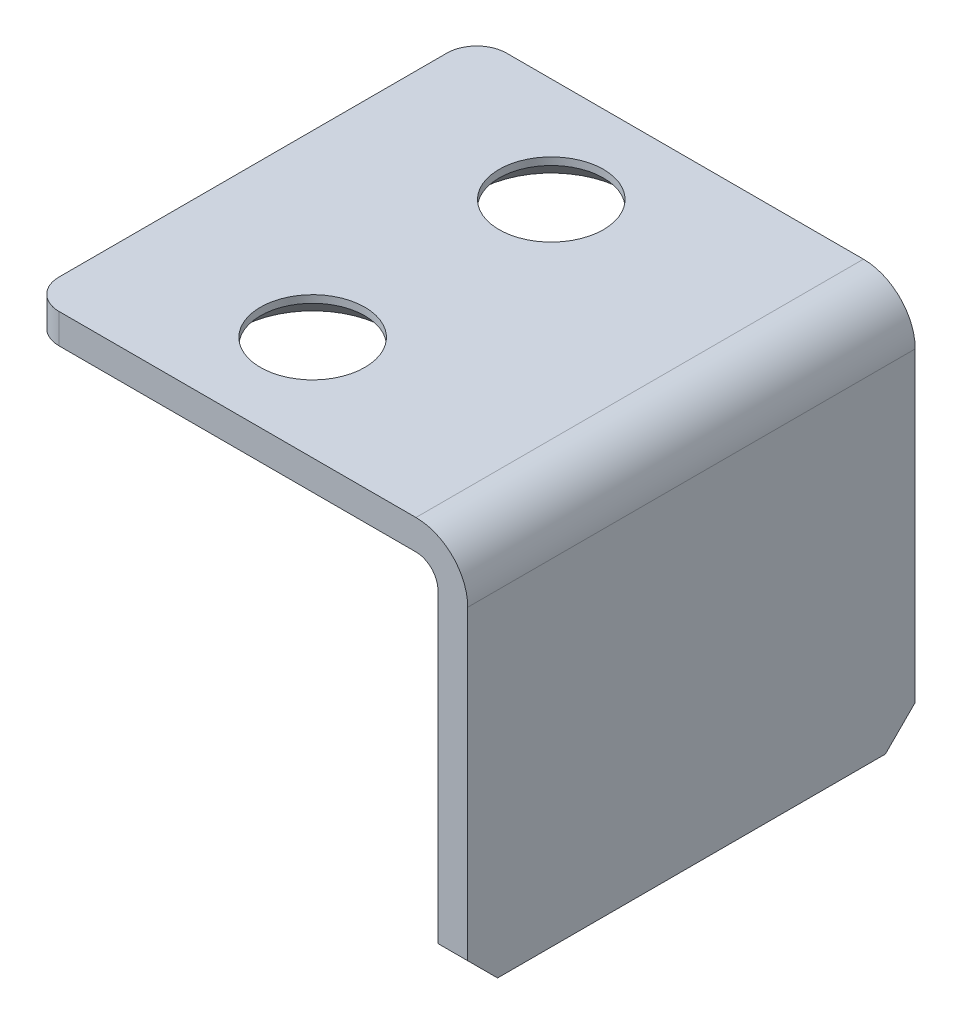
ISO-10303-21;
HEADER;
FILE_DESCRIPTION(('STEP AP214'),'2;1');
FILE_NAME('part.step','',(''),(''),'','','');
FILE_SCHEMA(('AUTOMOTIVE_DESIGN { 1 0 10303 214 1 1 1 1 }'));
ENDSEC;
DATA;
#1=APPLICATION_CONTEXT('core data for automotive mechanical design processes');
#2=APPLICATION_PROTOCOL_DEFINITION('international standard','automotive_design',2000,#1);
#3=PRODUCT_CONTEXT('',#1,'mechanical');
#4=PRODUCT('Part','Part','',(#3));
#5=PRODUCT_RELATED_PRODUCT_CATEGORY('part','',(#4));
#6=PRODUCT_DEFINITION_FORMATION('','',#4);
#7=PRODUCT_DEFINITION_CONTEXT('part definition',#1,'design');
#8=PRODUCT_DEFINITION('design','',#6,#7);
#9=PRODUCT_DEFINITION_SHAPE('','',#8);
#10=(LENGTH_UNIT() NAMED_UNIT(*) SI_UNIT(.MILLI.,.METRE.));
#11=(NAMED_UNIT(*) PLANE_ANGLE_UNIT() SI_UNIT($,.RADIAN.));
#12=(NAMED_UNIT(*) SI_UNIT($,.STERADIAN.) SOLID_ANGLE_UNIT());
#13=UNCERTAINTY_MEASURE_WITH_UNIT(LENGTH_MEASURE(1.E-05),#10,'distance_accuracy_value','');
#14=(GEOMETRIC_REPRESENTATION_CONTEXT(3) GLOBAL_UNCERTAINTY_ASSIGNED_CONTEXT((#13)) GLOBAL_UNIT_ASSIGNED_CONTEXT((#10,
#11,#12)) REPRESENTATION_CONTEXT('',''));
#15=CARTESIAN_POINT('',(0.,0.,0.));
#16=DIRECTION('',(0.,0.,1.));
#17=DIRECTION('',(1.,0.,0.));
#18=AXIS2_PLACEMENT_3D('',#15,#16,#17);
#19=CARTESIAN_POINT('',(50.0000000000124,-1.99999999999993,873.199999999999));
#20=DIRECTION('',(0.,-1.,0.));
#21=DIRECTION('',(0.,0.,-1.));
#22=AXIS2_PLACEMENT_3D('',#19,#20,#21);
#23=CONICAL_SURFACE('',#22,2.49999999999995,0.785398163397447);
#24=CARTESIAN_POINT('',(50.0000000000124,-1.99999999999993,873.199999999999));
#25=DIRECTION('',(0.,-1.,0.));
#26=DIRECTION('',(0.,0.,-1.));
#27=AXIS2_PLACEMENT_3D('',#24,#25,#26);
#28=CIRCLE('',#27,2.49999999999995);
#29=CARTESIAN_POINT('',(50.0000000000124,-1.99999999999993,870.699999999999));
#30=VERTEX_POINT('',#29);
#31=EDGE_CURVE('E11',#30,#30,#28,.T.);
#32=ORIENTED_EDGE('',*,*,#31,.T.);
#33=EDGE_LOOP('',(#32));
#34=FACE_BOUND('',#33,.T.);
#35=CARTESIAN_POINT('',(50.0000000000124,-1.24999999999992,873.199999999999));
#36=DIRECTION('',(0.,-1.,0.));
#37=DIRECTION('',(0.,0.,-1.));
#38=AXIS2_PLACEMENT_3D('',#35,#36,#37);
#39=CIRCLE('',#38,1.75000000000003);
#40=CARTESIAN_POINT('',(50.0000000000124,-1.24999999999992,871.449999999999));
#41=VERTEX_POINT('',#40);
#42=EDGE_CURVE('E252',#41,#41,#39,.T.);
#43=ORIENTED_EDGE('',*,*,#42,.F.);
#44=EDGE_LOOP('',(#43));
#45=FACE_BOUND('',#44,.T.);
#46=ADVANCED_FACE('F16',(#34,#45),#23,.F.);
#47=CARTESIAN_POINT('',(50.0000000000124,-1.99999999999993,873.199999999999));
#48=DIRECTION('',(0.,-1.,0.));
#49=DIRECTION('',(0.,0.,-1.));
#50=AXIS2_PLACEMENT_3D('',#47,#48,#49);
#51=CYLINDRICAL_SURFACE('',#50,1.75000000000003);
#52=ORIENTED_EDGE('',*,*,#42,.T.);
#53=EDGE_LOOP('',(#52));
#54=FACE_BOUND('',#53,.T.);
#55=CARTESIAN_POINT('',(50.0000000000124,-0.99999999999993,873.199999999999));
#56=DIRECTION('',(0.,1.,0.));
#57=DIRECTION('',(1.,0.,0.));
#58=AXIS2_PLACEMENT_3D('',#55,#56,#57);
#59=CIRCLE('',#58,1.74999999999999);
#60=CARTESIAN_POINT('',(51.7500000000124,-0.999999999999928,873.199999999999));
#61=VERTEX_POINT('',#60);
#62=EDGE_CURVE('E27',#61,#61,#59,.T.);
#63=ORIENTED_EDGE('',*,*,#62,.T.);
#64=EDGE_LOOP('',(#63));
#65=FACE_BOUND('',#64,.T.);
#66=ADVANCED_FACE('F263',(#54,#65),#51,.F.);
#67=CARTESIAN_POINT('',(50.0000000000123,-1.99999999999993,865.199999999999));
#68=DIRECTION('',(0.,-1.,0.));
#69=DIRECTION('',(0.,0.,-1.));
#70=AXIS2_PLACEMENT_3D('',#67,#68,#69);
#71=CONICAL_SURFACE('',#70,2.49999999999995,0.785398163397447);
#72=CARTESIAN_POINT('',(50.0000000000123,-1.99999999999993,865.199999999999));
#73=DIRECTION('',(0.,-1.,0.));
#74=DIRECTION('',(0.,0.,-1.));
#75=AXIS2_PLACEMENT_3D('',#72,#73,#74);
#76=CIRCLE('',#75,2.49999999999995);
#77=CARTESIAN_POINT('',(50.0000000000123,-1.99999999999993,862.699999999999));
#78=VERTEX_POINT('',#77);
#79=EDGE_CURVE('E248',#78,#78,#76,.T.);
#80=ORIENTED_EDGE('',*,*,#79,.T.);
#81=EDGE_LOOP('',(#80));
#82=FACE_BOUND('',#81,.T.);
#83=CARTESIAN_POINT('',(50.0000000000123,-1.24999999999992,865.199999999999));
#84=DIRECTION('',(0.,-1.,0.));
#85=DIRECTION('',(0.,0.,-1.));
#86=AXIS2_PLACEMENT_3D('',#83,#84,#85);
#87=CIRCLE('',#86,1.75000000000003);
#88=CARTESIAN_POINT('',(50.0000000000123,-1.24999999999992,863.449999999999));
#89=VERTEX_POINT('',#88);
#90=EDGE_CURVE('E241',#89,#89,#87,.T.);
#91=ORIENTED_EDGE('',*,*,#90,.F.);
#92=EDGE_LOOP('',(#91));
#93=FACE_BOUND('',#92,.T.);
#94=ADVANCED_FACE('F272',(#82,#93),#71,.F.);
#95=CARTESIAN_POINT('',(50.0000000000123,-1.99999999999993,865.199999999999));
#96=DIRECTION('',(0.,-1.,0.));
#97=DIRECTION('',(0.,0.,-1.));
#98=AXIS2_PLACEMENT_3D('',#95,#96,#97);
#99=CYLINDRICAL_SURFACE('',#98,1.75000000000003);
#100=ORIENTED_EDGE('',*,*,#90,.T.);
#101=EDGE_LOOP('',(#100));
#102=FACE_BOUND('',#101,.T.);
#103=CARTESIAN_POINT('',(50.0000000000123,-0.99999999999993,865.199999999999));
#104=DIRECTION('',(0.,1.,0.));
#105=DIRECTION('',(1.,0.,0.));
#106=AXIS2_PLACEMENT_3D('',#103,#104,#105);
#107=CIRCLE('',#106,1.74999999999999);
#108=CARTESIAN_POINT('',(51.7500000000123,-0.999999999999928,865.199999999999));
#109=VERTEX_POINT('',#108);
#110=EDGE_CURVE('E244',#109,#109,#107,.T.);
#111=ORIENTED_EDGE('',*,*,#110,.T.);
#112=EDGE_LOOP('',(#111));
#113=FACE_BOUND('',#112,.T.);
#114=ADVANCED_FACE('F277',(#102,#113),#99,.F.);
#115=CARTESIAN_POINT('',(56.9634000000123,-0.999999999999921,861.699999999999));
#116=DIRECTION('',(0.,0.,-1.));
#117=DIRECTION('',(0.,1.,0.));
#118=AXIS2_PLACEMENT_3D('',#115,#116,#117);
#119=PLANE('',#118);
#120=CARTESIAN_POINT('',(56.9634000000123,-2.73659999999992,861.699999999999));
#121=DIRECTION('',(0.,0.,1.));
#122=DIRECTION('',(0.,1.,0.));
#123=AXIS2_PLACEMENT_3D('',#120,#121,#122);
#124=CIRCLE('',#123,0.7366);
#125=CARTESIAN_POINT('',(57.7000000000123,-2.73659999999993,861.699999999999));
#126=VERTEX_POINT('',#125);
#127=CARTESIAN_POINT('',(56.9634000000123,-1.99999999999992,861.699999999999));
#128=VERTEX_POINT('',#127);
#129=EDGE_CURVE('E238',#126,#128,#124,.T.);
#130=ORIENTED_EDGE('',*,*,#129,.T.);
#131=DIRECTION('',(-1.,0.,0.));
#132=VECTOR('',#131,1.);
#133=CARTESIAN_POINT('',(58.7000000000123,-1.99999999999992,861.699999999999));
#134=LINE('',#133,#132);
#135=CARTESIAN_POINT('',(45.0000000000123,-1.99999999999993,861.699999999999));
#136=VERTEX_POINT('',#135);
#137=EDGE_CURVE('E234',#128,#136,#134,.T.);
#138=ORIENTED_EDGE('',*,*,#137,.T.);
#139=DIRECTION('',(0.,1.,0.));
#140=VECTOR('',#139,1.);
#141=CARTESIAN_POINT('',(45.0000000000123,-2.73659999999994,861.699999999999));
#142=LINE('',#141,#140);
#143=CARTESIAN_POINT('',(45.0000000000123,-0.999999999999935,861.699999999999));
#144=VERTEX_POINT('',#143);
#145=EDGE_CURVE('E228',#136,#144,#142,.T.);
#146=ORIENTED_EDGE('',*,*,#145,.T.);
#147=DIRECTION('',(-1.,0.,0.));
#148=VECTOR('',#147,1.);
#149=CARTESIAN_POINT('',(58.7000000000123,-0.999999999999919,861.699999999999));
#150=LINE('',#149,#148);
#151=CARTESIAN_POINT('',(56.9634000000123,-0.999999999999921,861.699999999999));
#152=VERTEX_POINT('',#151);
#153=EDGE_CURVE('E183',#152,#144,#150,.T.);
#154=ORIENTED_EDGE('',*,*,#153,.F.);
#155=CARTESIAN_POINT('',(56.9634000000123,-2.73659999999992,861.699999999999));
#156=DIRECTION('',(0.,0.,1.));
#157=DIRECTION('',(0.,1.,0.));
#158=AXIS2_PLACEMENT_3D('',#155,#156,#157);
#159=CIRCLE('',#158,1.7366);
#160=CARTESIAN_POINT('',(58.7000000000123,-2.73659999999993,861.699999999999));
#161=VERTEX_POINT('',#160);
#162=EDGE_CURVE('E36',#161,#152,#159,.T.);
#163=ORIENTED_EDGE('',*,*,#162,.F.);
#164=DIRECTION('',(0.,1.,0.));
#165=VECTOR('',#164,1.);
#166=CARTESIAN_POINT('',(58.7000000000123,-13.9999999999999,861.699999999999));
#167=LINE('',#166,#165);
#168=CARTESIAN_POINT('',(58.7000000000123,-12.9999999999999,861.699999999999));
#169=VERTEX_POINT('',#168);
#170=EDGE_CURVE('E135',#169,#161,#167,.T.);
#171=ORIENTED_EDGE('',*,*,#170,.F.);
#172=DIRECTION('',(-1.,0.,0.));
#173=VECTOR('',#172,1.);
#174=CARTESIAN_POINT('',(56.9634000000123,-12.9999999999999,861.699999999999));
#175=LINE('',#174,#173);
#176=CARTESIAN_POINT('',(57.7000000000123,-12.9999999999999,861.699999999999));
#177=VERTEX_POINT('',#176);
#178=EDGE_CURVE('E120',#169,#177,#175,.T.);
#179=ORIENTED_EDGE('',*,*,#178,.T.);
#180=DIRECTION('',(0.,1.,0.));
#181=VECTOR('',#180,1.);
#182=CARTESIAN_POINT('',(57.7000000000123,-13.9999999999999,861.699999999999));
#183=LINE('',#182,#181);
#184=EDGE_CURVE('E108',#177,#126,#183,.T.);
#185=ORIENTED_EDGE('',*,*,#184,.T.);
#186=EDGE_LOOP('',(#130,#138,#146,#154,#163,#171,#179,#185));
#187=FACE_BOUND('',#186,.T.);
#188=ADVANCED_FACE('F133',(#187),#119,.T.);
#189=CARTESIAN_POINT('',(58.7000000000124,-2.73659999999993,876.699999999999));
#190=DIRECTION('',(0.,0.,1.));
#191=DIRECTION('',(0.,-1.,0.));
#192=AXIS2_PLACEMENT_3D('',#189,#190,#191);
#193=PLANE('',#192);
#194=CARTESIAN_POINT('',(56.9634000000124,-2.73659999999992,876.699999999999));
#195=DIRECTION('',(0.,0.,1.));
#196=DIRECTION('',(0.,1.,0.));
#197=AXIS2_PLACEMENT_3D('',#194,#195,#196);
#198=CIRCLE('',#197,0.7366);
#199=CARTESIAN_POINT('',(57.7000000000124,-2.73659999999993,876.699999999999));
#200=VERTEX_POINT('',#199);
#201=CARTESIAN_POINT('',(56.9634000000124,-1.99999999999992,876.699999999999));
#202=VERTEX_POINT('',#201);
#203=EDGE_CURVE('E142',#200,#202,#198,.T.);
#204=ORIENTED_EDGE('',*,*,#203,.F.);
#205=DIRECTION('',(0.,1.,0.));
#206=VECTOR('',#205,1.);
#207=CARTESIAN_POINT('',(57.7000000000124,-13.9999999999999,876.699999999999));
#208=LINE('',#207,#206);
#209=CARTESIAN_POINT('',(57.7000000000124,-12.9999999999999,876.699999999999));
#210=VERTEX_POINT('',#209);
#211=EDGE_CURVE('E147',#210,#200,#208,.T.);
#212=ORIENTED_EDGE('',*,*,#211,.F.);
#213=DIRECTION('',(1.,0.,0.));
#214=VECTOR('',#213,1.);
#215=CARTESIAN_POINT('',(56.9634000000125,-12.9999999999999,876.699999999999));
#216=LINE('',#215,#214);
#217=CARTESIAN_POINT('',(58.7000000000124,-12.9999999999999,876.699999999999));
#218=VERTEX_POINT('',#217);
#219=EDGE_CURVE('E216',#210,#218,#216,.T.);
#220=ORIENTED_EDGE('',*,*,#219,.T.);
#221=DIRECTION('',(0.,1.,0.));
#222=VECTOR('',#221,1.);
#223=CARTESIAN_POINT('',(58.7000000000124,-13.9999999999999,876.699999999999));
#224=LINE('',#223,#222);
#225=CARTESIAN_POINT('',(58.7000000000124,-2.73659999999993,876.699999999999));
#226=VERTEX_POINT('',#225);
#227=EDGE_CURVE('E211',#218,#226,#224,.T.);
#228=ORIENTED_EDGE('',*,*,#227,.T.);
#229=CARTESIAN_POINT('',(56.9634000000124,-2.73659999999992,876.699999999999));
#230=DIRECTION('',(0.,0.,1.));
#231=DIRECTION('',(0.,1.,0.));
#232=AXIS2_PLACEMENT_3D('',#229,#230,#231);
#233=CIRCLE('',#232,1.7366);
#234=CARTESIAN_POINT('',(56.9634000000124,-0.999999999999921,876.699999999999));
#235=VERTEX_POINT('',#234);
#236=EDGE_CURVE('E220',#226,#235,#233,.T.);
#237=ORIENTED_EDGE('',*,*,#236,.T.);
#238=DIRECTION('',(-1.,0.,0.));
#239=VECTOR('',#238,1.);
#240=CARTESIAN_POINT('',(58.7000000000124,-0.999999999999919,876.699999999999));
#241=LINE('',#240,#239);
#242=CARTESIAN_POINT('',(45.0000000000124,-0.999999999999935,876.699999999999));
#243=VERTEX_POINT('',#242);
#244=EDGE_CURVE('E121',#235,#243,#241,.T.);
#245=ORIENTED_EDGE('',*,*,#244,.T.);
#246=DIRECTION('',(0.,-1.,0.));
#247=VECTOR('',#246,1.);
#248=CARTESIAN_POINT('',(45.0000000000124,-1.99999999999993,876.699999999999));
#249=LINE('',#248,#247);
#250=CARTESIAN_POINT('',(45.0000000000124,-1.99999999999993,876.699999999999));
#251=VERTEX_POINT('',#250);
#252=EDGE_CURVE('E20',#243,#251,#249,.T.);
#253=ORIENTED_EDGE('',*,*,#252,.T.);
#254=DIRECTION('',(-1.,0.,0.));
#255=VECTOR('',#254,1.);
#256=CARTESIAN_POINT('',(58.7000000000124,-1.99999999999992,876.699999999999));
#257=LINE('',#256,#255);
#258=EDGE_CURVE('E199',#202,#251,#257,.T.);
#259=ORIENTED_EDGE('',*,*,#258,.F.);
#260=EDGE_LOOP('',(#204,#212,#220,#228,#237,#245,#253,#259));
#261=FACE_BOUND('',#260,.T.);
#262=ADVANCED_FACE('F284',(#261),#193,.T.);
#263=CARTESIAN_POINT('',(58.7000000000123,-1.99999999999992,861.699999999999));
#264=DIRECTION('',(0.,1.,0.));
#265=DIRECTION('',(1.,0.,0.));
#266=AXIS2_PLACEMENT_3D('',#263,#264,#265);
#267=PLANE('',#266);
#268=ORIENTED_EDGE('',*,*,#31,.F.);
#269=EDGE_LOOP('',(#268));
#270=FACE_BOUND('',#269,.T.);
#271=ORIENTED_EDGE('',*,*,#79,.F.);
#272=EDGE_LOOP('',(#271));
#273=FACE_BOUND('',#272,.T.);
#274=DIRECTION('',(0.,0.,1.));
#275=VECTOR('',#274,1.);
#276=CARTESIAN_POINT('',(44.0000000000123,-1.99999999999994,861.699999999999));
#277=LINE('',#276,#275);
#278=CARTESIAN_POINT('',(44.0000000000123,-1.99999999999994,862.699999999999));
#279=VERTEX_POINT('',#278);
#280=CARTESIAN_POINT('',(44.0000000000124,-1.99999999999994,875.699999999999));
#281=VERTEX_POINT('',#280);
#282=EDGE_CURVE('E188',#279,#281,#277,.T.);
#283=ORIENTED_EDGE('',*,*,#282,.F.);
#284=CARTESIAN_POINT('',(45.0000000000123,-1.99999999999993,862.699999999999));
#285=DIRECTION('',(0.,-1.,0.));
#286=DIRECTION('',(1.,0.,0.));
#287=AXIS2_PLACEMENT_3D('',#284,#285,#286);
#288=CIRCLE('',#287,1.);
#289=EDGE_CURVE('E207',#279,#136,#288,.T.);
#290=ORIENTED_EDGE('',*,*,#289,.T.);
#291=ORIENTED_EDGE('',*,*,#137,.F.);
#292=DIRECTION('',(0.,0.,1.));
#293=VECTOR('',#292,1.);
#294=CARTESIAN_POINT('',(56.9634000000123,-1.99999999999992,861.699999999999));
#295=LINE('',#294,#293);
#296=EDGE_CURVE('E203',#128,#202,#295,.T.);
#297=ORIENTED_EDGE('',*,*,#296,.T.);
#298=ORIENTED_EDGE('',*,*,#258,.T.);
#299=CARTESIAN_POINT('',(45.0000000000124,-1.99999999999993,875.699999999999));
#300=DIRECTION('',(0.,-1.,0.));
#301=DIRECTION('',(1.,0.,0.));
#302=AXIS2_PLACEMENT_3D('',#299,#300,#301);
#303=CIRCLE('',#302,1.);
#304=EDGE_CURVE('E193',#251,#281,#303,.T.);
#305=ORIENTED_EDGE('',*,*,#304,.T.);
#306=EDGE_LOOP('',(#283,#290,#291,#297,#298,#305));
#307=FACE_BOUND('',#306,.T.);
#308=ADVANCED_FACE('F287',(#270,#273,#307),#267,.F.);
#309=CARTESIAN_POINT('',(44.0000000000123,-0.999999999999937,861.699999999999));
#310=DIRECTION('',(-1.,0.,0.));
#311=DIRECTION('',(0.,0.,1.));
#312=AXIS2_PLACEMENT_3D('',#309,#310,#311);
#313=PLANE('',#312);
#314=DIRECTION('',(0.,0.,1.));
#315=VECTOR('',#314,1.);
#316=CARTESIAN_POINT('',(44.0000000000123,-0.999999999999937,861.699999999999));
#317=LINE('',#316,#315);
#318=CARTESIAN_POINT('',(44.0000000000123,-0.999999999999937,862.699999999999));
#319=VERTEX_POINT('',#318);
#320=CARTESIAN_POINT('',(44.0000000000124,-0.999999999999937,875.699999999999));
#321=VERTEX_POINT('',#320);
#322=EDGE_CURVE('E178',#319,#321,#317,.T.);
#323=ORIENTED_EDGE('',*,*,#322,.F.);
#324=DIRECTION('',(0.,-1.,0.));
#325=VECTOR('',#324,1.);
#326=CARTESIAN_POINT('',(44.0000000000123,-0.999999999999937,862.699999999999));
#327=LINE('',#326,#325);
#328=EDGE_CURVE('E189',#319,#279,#327,.T.);
#329=ORIENTED_EDGE('',*,*,#328,.T.);
#330=ORIENTED_EDGE('',*,*,#282,.T.);
#331=DIRECTION('',(0.,1.,0.));
#332=VECTOR('',#331,1.);
#333=CARTESIAN_POINT('',(44.0000000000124,-0.999999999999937,875.699999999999));
#334=LINE('',#333,#332);
#335=EDGE_CURVE('E184',#281,#321,#334,.T.);
#336=ORIENTED_EDGE('',*,*,#335,.T.);
#337=EDGE_LOOP('',(#323,#329,#330,#336));
#338=FACE_BOUND('',#337,.T.);
#339=ADVANCED_FACE('F291',(#338),#313,.T.);
#340=CARTESIAN_POINT('',(58.7000000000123,-0.999999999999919,861.699999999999));
#341=DIRECTION('',(0.,1.,0.));
#342=DIRECTION('',(1.,0.,0.));
#343=AXIS2_PLACEMENT_3D('',#340,#341,#342);
#344=PLANE('',#343);
#345=ORIENTED_EDGE('',*,*,#62,.F.);
#346=EDGE_LOOP('',(#345));
#347=FACE_BOUND('',#346,.T.);
#348=ORIENTED_EDGE('',*,*,#110,.F.);
#349=EDGE_LOOP('',(#348));
#350=FACE_BOUND('',#349,.T.);
#351=ORIENTED_EDGE('',*,*,#153,.T.);
#352=CARTESIAN_POINT('',(45.0000000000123,-0.999999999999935,862.699999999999));
#353=DIRECTION('',(0.,1.,0.));
#354=DIRECTION('',(1.,0.,0.));
#355=AXIS2_PLACEMENT_3D('',#352,#353,#354);
#356=CIRCLE('',#355,1.);
#357=EDGE_CURVE('E179',#144,#319,#356,.T.);
#358=ORIENTED_EDGE('',*,*,#357,.T.);
#359=ORIENTED_EDGE('',*,*,#322,.T.);
#360=CARTESIAN_POINT('',(45.0000000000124,-0.999999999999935,875.699999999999));
#361=DIRECTION('',(0.,1.,0.));
#362=DIRECTION('',(1.,0.,0.));
#363=AXIS2_PLACEMENT_3D('',#360,#361,#362);
#364=CIRCLE('',#363,1.);
#365=EDGE_CURVE('E174',#321,#243,#364,.T.);
#366=ORIENTED_EDGE('',*,*,#365,.T.);
#367=ORIENTED_EDGE('',*,*,#244,.F.);
#368=DIRECTION('',(0.,0.,1.));
#369=VECTOR('',#368,1.);
#370=CARTESIAN_POINT('',(56.9634000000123,-0.999999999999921,861.699999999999));
#371=LINE('',#370,#369);
#372=EDGE_CURVE('E165',#152,#235,#371,.T.);
#373=ORIENTED_EDGE('',*,*,#372,.F.);
#374=EDGE_LOOP('',(#351,#358,#359,#366,#367,#373));
#375=FACE_BOUND('',#374,.T.);
#376=ADVANCED_FACE('F295',(#347,#350,#375),#344,.T.);
#377=CARTESIAN_POINT('',(56.9634000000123,-2.73659999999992,861.699999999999));
#378=DIRECTION('',(0.,0.,1.));
#379=DIRECTION('',(0.,-1.,0.));
#380=AXIS2_PLACEMENT_3D('',#377,#378,#379);
#381=CYLINDRICAL_SURFACE('',#380,1.7366);
#382=ORIENTED_EDGE('',*,*,#236,.F.);
#383=DIRECTION('',(0.,0.,1.));
#384=VECTOR('',#383,1.);
#385=CARTESIAN_POINT('',(58.7000000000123,-2.73659999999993,861.699999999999));
#386=LINE('',#385,#384);
#387=EDGE_CURVE('E160',#161,#226,#386,.T.);
#388=ORIENTED_EDGE('',*,*,#387,.F.);
#389=ORIENTED_EDGE('',*,*,#162,.T.);
#390=ORIENTED_EDGE('',*,*,#372,.T.);
#391=EDGE_LOOP('',(#382,#388,#389,#390));
#392=FACE_BOUND('',#391,.T.);
#393=ADVANCED_FACE('F299',(#392),#381,.T.);
#394=CARTESIAN_POINT('',(58.7000000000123,-13.9999999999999,861.699999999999));
#395=DIRECTION('',(1.,0.,0.));
#396=DIRECTION('',(0.,0.,-1.));
#397=AXIS2_PLACEMENT_3D('',#394,#395,#396);
#398=PLANE('',#397);
#399=DIRECTION('',(0.,0.,1.));
#400=VECTOR('',#399,1.);
#401=CARTESIAN_POINT('',(58.7000000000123,-13.9999999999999,861.699999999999));
#402=LINE('',#401,#400);
#403=CARTESIAN_POINT('',(58.7000000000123,-13.9999999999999,862.699999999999));
#404=VERTEX_POINT('',#403);
#405=CARTESIAN_POINT('',(58.7000000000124,-13.9999999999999,875.699999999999));
#406=VERTEX_POINT('',#405);
#407=EDGE_CURVE('E151',#404,#406,#402,.T.);
#408=ORIENTED_EDGE('',*,*,#407,.F.);
#409=DIRECTION('',(0.,0.707106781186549,-0.707106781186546));
#410=VECTOR('',#409,1.);
#411=CARTESIAN_POINT('',(58.7000000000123,-13.4999999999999,862.199999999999));
#412=LINE('',#411,#410);
#413=EDGE_CURVE('E163',#404,#169,#412,.T.);
#414=ORIENTED_EDGE('',*,*,#413,.T.);
#415=ORIENTED_EDGE('',*,*,#170,.T.);
#416=ORIENTED_EDGE('',*,*,#387,.T.);
#417=ORIENTED_EDGE('',*,*,#227,.F.);
#418=DIRECTION('',(0.,-0.707106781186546,-0.707106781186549));
#419=VECTOR('',#418,1.);
#420=CARTESIAN_POINT('',(58.7000000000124,-20.9999999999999,868.699999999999));
#421=LINE('',#420,#419);
#422=EDGE_CURVE('E154',#218,#406,#421,.T.);
#423=ORIENTED_EDGE('',*,*,#422,.T.);
#424=EDGE_LOOP('',(#408,#414,#415,#416,#417,#423));
#425=FACE_BOUND('',#424,.T.);
#426=ADVANCED_FACE('F303',(#425),#398,.T.);
#427=CARTESIAN_POINT('',(57.7000000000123,-13.9999999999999,861.699999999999));
#428=DIRECTION('',(0.,-1.,0.));
#429=DIRECTION('',(0.,0.,-1.));
#430=AXIS2_PLACEMENT_3D('',#427,#428,#429);
#431=PLANE('',#430);
#432=DIRECTION('',(0.,0.,1.));
#433=VECTOR('',#432,1.);
#434=CARTESIAN_POINT('',(57.7000000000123,-13.9999999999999,861.699999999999));
#435=LINE('',#434,#433);
#436=CARTESIAN_POINT('',(57.7000000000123,-13.9999999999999,862.699999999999));
#437=VERTEX_POINT('',#436);
#438=CARTESIAN_POINT('',(57.7000000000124,-13.9999999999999,875.699999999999));
#439=VERTEX_POINT('',#438);
#440=EDGE_CURVE('E104',#437,#439,#435,.T.);
#441=ORIENTED_EDGE('',*,*,#440,.F.);
#442=DIRECTION('',(1.,0.,0.));
#443=VECTOR('',#442,1.);
#444=CARTESIAN_POINT('',(57.7000000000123,-13.9999999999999,862.699999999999));
#445=LINE('',#444,#443);
#446=EDGE_CURVE('E129',#437,#404,#445,.T.);
#447=ORIENTED_EDGE('',*,*,#446,.T.);
#448=ORIENTED_EDGE('',*,*,#407,.T.);
#449=DIRECTION('',(-1.,0.,0.));
#450=VECTOR('',#449,1.);
#451=CARTESIAN_POINT('',(57.7000000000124,-13.9999999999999,875.699999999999));
#452=LINE('',#451,#450);
#453=EDGE_CURVE('E131',#406,#439,#452,.T.);
#454=ORIENTED_EDGE('',*,*,#453,.T.);
#455=EDGE_LOOP('',(#441,#447,#448,#454));
#456=FACE_BOUND('',#455,.T.);
#457=ADVANCED_FACE('F306',(#456),#431,.T.);
#458=CARTESIAN_POINT('',(57.7000000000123,-13.9999999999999,861.699999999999));
#459=DIRECTION('',(1.,0.,0.));
#460=DIRECTION('',(0.,0.,-1.));
#461=AXIS2_PLACEMENT_3D('',#458,#459,#460);
#462=PLANE('',#461);
#463=ORIENTED_EDGE('',*,*,#184,.F.);
#464=DIRECTION('',(0.,-0.707106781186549,0.707106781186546));
#465=VECTOR('',#464,1.);
#466=CARTESIAN_POINT('',(57.7000000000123,-13.9999999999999,862.699999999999));
#467=LINE('',#466,#465);
#468=EDGE_CURVE('E111',#177,#437,#467,.T.);
#469=ORIENTED_EDGE('',*,*,#468,.T.);
#470=ORIENTED_EDGE('',*,*,#440,.T.);
#471=DIRECTION('',(0.,0.707106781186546,0.707106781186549));
#472=VECTOR('',#471,1.);
#473=CARTESIAN_POINT('',(57.7000000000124,-12.9999999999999,876.699999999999));
#474=LINE('',#473,#472);
#475=EDGE_CURVE('E145',#439,#210,#474,.T.);
#476=ORIENTED_EDGE('',*,*,#475,.T.);
#477=ORIENTED_EDGE('',*,*,#211,.T.);
#478=DIRECTION('',(0.,0.,1.));
#479=VECTOR('',#478,1.);
#480=CARTESIAN_POINT('',(57.7000000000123,-2.73659999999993,861.699999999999));
#481=LINE('',#480,#479);
#482=EDGE_CURVE('E114',#126,#200,#481,.T.);
#483=ORIENTED_EDGE('',*,*,#482,.F.);
#484=EDGE_LOOP('',(#463,#469,#470,#476,#477,#483));
#485=FACE_BOUND('',#484,.T.);
#486=ADVANCED_FACE('F110',(#485),#462,.F.);
#487=CARTESIAN_POINT('',(56.9634000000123,-2.73659999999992,861.699999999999));
#488=DIRECTION('',(0.,0.,1.));
#489=DIRECTION('',(0.,-1.,0.));
#490=AXIS2_PLACEMENT_3D('',#487,#488,#489);
#491=CYLINDRICAL_SURFACE('',#490,0.7366);
#492=ORIENTED_EDGE('',*,*,#203,.T.);
#493=ORIENTED_EDGE('',*,*,#296,.F.);
#494=ORIENTED_EDGE('',*,*,#129,.F.);
#495=ORIENTED_EDGE('',*,*,#482,.T.);
#496=EDGE_LOOP('',(#492,#493,#494,#495));
#497=FACE_BOUND('',#496,.T.);
#498=ADVANCED_FACE('F313',(#497),#491,.F.);
#499=CARTESIAN_POINT('',(57.7000000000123,-13.9999999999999,862.699999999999));
#500=DIRECTION('',(0.,0.707106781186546,0.707106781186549));
#501=DIRECTION('',(1.,0.,0.));
#502=AXIS2_PLACEMENT_3D('',#499,#500,#501);
#503=PLANE('',#502);
#504=ORIENTED_EDGE('',*,*,#468,.F.);
#505=ORIENTED_EDGE('',*,*,#178,.F.);
#506=ORIENTED_EDGE('',*,*,#413,.F.);
#507=ORIENTED_EDGE('',*,*,#446,.F.);
#508=EDGE_LOOP('',(#504,#505,#506,#507));
#509=FACE_BOUND('',#508,.T.);
#510=ADVANCED_FACE('F126',(#509),#503,.F.);
#511=CARTESIAN_POINT('',(56.9634000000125,-12.9999999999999,876.699999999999));
#512=DIRECTION('',(0.,0.707106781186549,-0.707106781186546));
#513=DIRECTION('',(1.,0.,0.));
#514=AXIS2_PLACEMENT_3D('',#511,#512,#513);
#515=PLANE('',#514);
#516=ORIENTED_EDGE('',*,*,#475,.F.);
#517=ORIENTED_EDGE('',*,*,#453,.F.);
#518=ORIENTED_EDGE('',*,*,#422,.F.);
#519=ORIENTED_EDGE('',*,*,#219,.F.);
#520=EDGE_LOOP('',(#516,#517,#518,#519));
#521=FACE_BOUND('',#520,.T.);
#522=ADVANCED_FACE('F319',(#521),#515,.F.);
#523=CARTESIAN_POINT('',(45.0000000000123,-0.999999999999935,862.699999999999));
#524=DIRECTION('',(0.,-1.,0.));
#525=DIRECTION('',(0.,0.,-1.));
#526=AXIS2_PLACEMENT_3D('',#523,#524,#525);
#527=CYLINDRICAL_SURFACE('',#526,1.);
#528=ORIENTED_EDGE('',*,*,#357,.F.);
#529=ORIENTED_EDGE('',*,*,#145,.F.);
#530=ORIENTED_EDGE('',*,*,#289,.F.);
#531=ORIENTED_EDGE('',*,*,#328,.F.);
#532=EDGE_LOOP('',(#528,#529,#530,#531));
#533=FACE_BOUND('',#532,.T.);
#534=ADVANCED_FACE('F321',(#533),#527,.T.);
#535=CARTESIAN_POINT('',(45.0000000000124,-2.73659999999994,875.699999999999));
#536=DIRECTION('',(0.,1.,0.));
#537=DIRECTION('',(0.,0.,1.));
#538=AXIS2_PLACEMENT_3D('',#535,#536,#537);
#539=CYLINDRICAL_SURFACE('',#538,1.);
#540=ORIENTED_EDGE('',*,*,#365,.F.);
#541=ORIENTED_EDGE('',*,*,#335,.F.);
#542=ORIENTED_EDGE('',*,*,#304,.F.);
#543=ORIENTED_EDGE('',*,*,#252,.F.);
#544=EDGE_LOOP('',(#540,#541,#542,#543));
#545=FACE_BOUND('',#544,.T.);
#546=ADVANCED_FACE('F18',(#545),#539,.T.);
#547=CLOSED_SHELL('',(#46,#66,#94,#114,#188,#262,#308,#339,#376,#393,#426,#457,#486,#498,#510,
#522,#534,#546));
#548=MANIFOLD_SOLID_BREP('B1',#547);
#549=ADVANCED_BREP_SHAPE_REPRESENTATION('',(#18,#548),#14);
#550=SHAPE_DEFINITION_REPRESENTATION(#9,#549);
ENDSEC;
END-ISO-10303-21;
